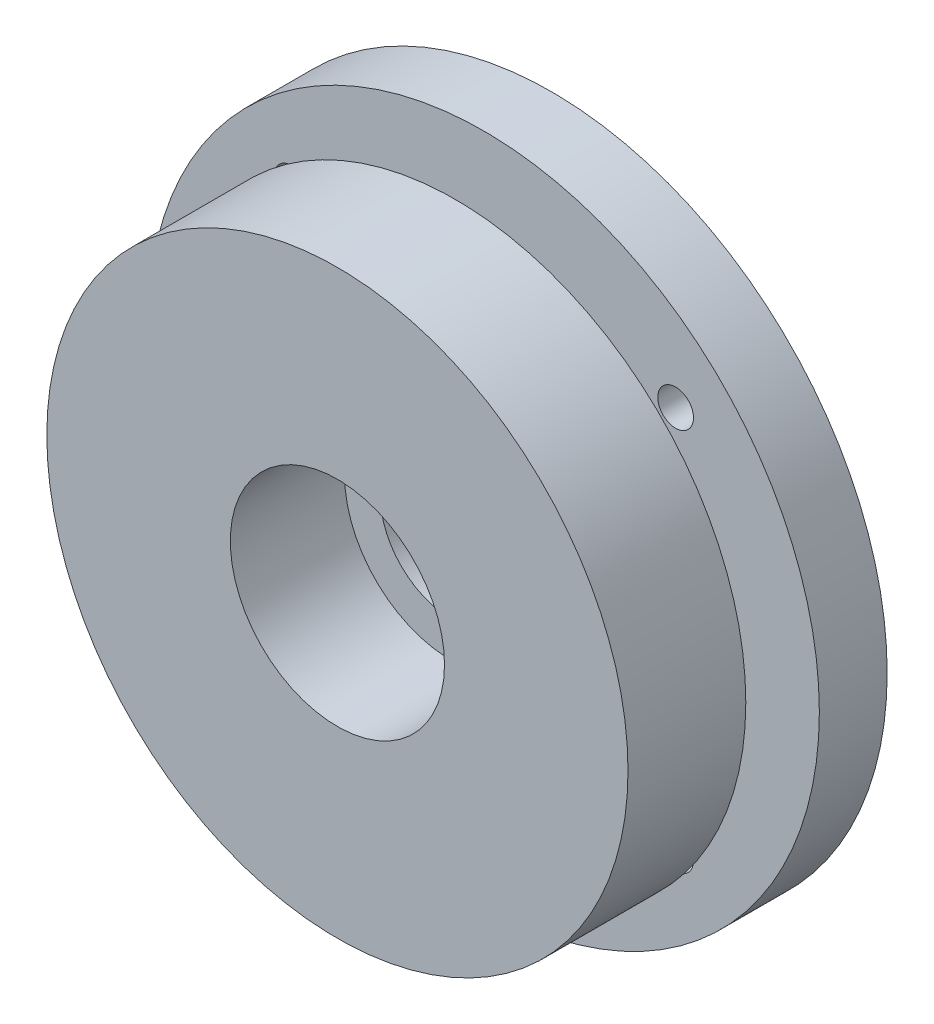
ISO-10303-21;
HEADER;
FILE_DESCRIPTION(('STEP AP214'),'2;1');
FILE_NAME('part.step','',(''),(''),'','','');
FILE_SCHEMA(('AUTOMOTIVE_DESIGN { 1 0 10303 214 1 1 1 1 }'));
ENDSEC;
DATA;
#1=APPLICATION_CONTEXT('core data for automotive mechanical design processes');
#2=APPLICATION_PROTOCOL_DEFINITION('international standard','automotive_design',2000,#1);
#3=PRODUCT_CONTEXT('',#1,'mechanical');
#4=PRODUCT('Part','Part','',(#3));
#5=PRODUCT_RELATED_PRODUCT_CATEGORY('part','',(#4));
#6=PRODUCT_DEFINITION_FORMATION('','',#4);
#7=PRODUCT_DEFINITION_CONTEXT('part definition',#1,'design');
#8=PRODUCT_DEFINITION('design','',#6,#7);
#9=PRODUCT_DEFINITION_SHAPE('','',#8);
#10=(LENGTH_UNIT() NAMED_UNIT(*) SI_UNIT(.MILLI.,.METRE.));
#11=(NAMED_UNIT(*) PLANE_ANGLE_UNIT() SI_UNIT($,.RADIAN.));
#12=(NAMED_UNIT(*) SI_UNIT($,.STERADIAN.) SOLID_ANGLE_UNIT());
#13=UNCERTAINTY_MEASURE_WITH_UNIT(LENGTH_MEASURE(1.E-05),#10,'distance_accuracy_value','');
#14=(GEOMETRIC_REPRESENTATION_CONTEXT(3) GLOBAL_UNCERTAINTY_ASSIGNED_CONTEXT((#13)) GLOBAL_UNIT_ASSIGNED_CONTEXT((#10,
#11,#12)) REPRESENTATION_CONTEXT('',''));
#15=CARTESIAN_POINT('',(0.,0.,0.));
#16=DIRECTION('',(0.,0.,1.));
#17=DIRECTION('',(1.,0.,0.));
#18=AXIS2_PLACEMENT_3D('',#15,#16,#17);
#19=CARTESIAN_POINT('',(0.,0.,-133.5));
#20=DIRECTION('',(0.,0.,1.));
#21=DIRECTION('',(1.,0.,0.));
#22=AXIS2_PLACEMENT_3D('',#19,#20,#21);
#23=CYLINDRICAL_SURFACE('',#22,7.5);
#24=CARTESIAN_POINT('',(0.,0.,15.));
#25=DIRECTION('',(0.,0.,1.));
#26=DIRECTION('',(1.,0.,0.));
#27=AXIS2_PLACEMENT_3D('',#24,#25,#26);
#28=CIRCLE('',#27,7.5);
#29=CARTESIAN_POINT('',(7.5,0.,15.));
#30=VERTEX_POINT('',#29);
#31=EDGE_CURVE('E95',#30,#30,#28,.T.);
#32=ORIENTED_EDGE('',*,*,#31,.T.);
#33=EDGE_LOOP('',(#32));
#34=FACE_BOUND('',#33,.T.);
#35=CARTESIAN_POINT('',(0.,0.,7.));
#36=DIRECTION('',(0.,0.,-1.));
#37=DIRECTION('',(-1.,0.,0.));
#38=AXIS2_PLACEMENT_3D('',#35,#36,#37);
#39=CIRCLE('',#38,7.5);
#40=CARTESIAN_POINT('',(-7.5,0.,7.));
#41=VERTEX_POINT('',#40);
#42=EDGE_CURVE('E10',#41,#41,#39,.F.);
#43=ORIENTED_EDGE('',*,*,#42,.F.);
#44=EDGE_LOOP('',(#43));
#45=FACE_BOUND('',#44,.T.);
#46=ADVANCED_FACE('F14',(#34,#45),#23,.F.);
#47=CARTESIAN_POINT('',(0.,0.,15.));
#48=DIRECTION('',(0.,0.,-1.));
#49=DIRECTION('',(-1.,0.,0.));
#50=AXIS2_PLACEMENT_3D('',#47,#48,#49);
#51=CYLINDRICAL_SURFACE('',#50,20.35);
#52=CARTESIAN_POINT('',(0.,0.,15.));
#53=DIRECTION('',(0.,0.,1.));
#54=DIRECTION('',(1.,0.,0.));
#55=AXIS2_PLACEMENT_3D('',#52,#53,#54);
#56=CIRCLE('',#55,20.35);
#57=CARTESIAN_POINT('',(20.35,0.,15.));
#58=VERTEX_POINT('',#57);
#59=EDGE_CURVE('E23',#58,#58,#56,.T.);
#60=ORIENTED_EDGE('',*,*,#59,.F.);
#61=EDGE_LOOP('',(#60));
#62=FACE_BOUND('',#61,.T.);
#63=CARTESIAN_POINT('',(0.,0.,6.75));
#64=DIRECTION('',(0.,0.,1.));
#65=DIRECTION('',(1.,0.,0.));
#66=AXIS2_PLACEMENT_3D('',#63,#64,#65);
#67=CIRCLE('',#66,20.35);
#68=CARTESIAN_POINT('',(20.35,0.,6.75));
#69=VERTEX_POINT('',#68);
#70=EDGE_CURVE('E33',#69,#69,#67,.T.);
#71=ORIENTED_EDGE('',*,*,#70,.T.);
#72=EDGE_LOOP('',(#71));
#73=FACE_BOUND('',#72,.T.);
#74=ADVANCED_FACE('F16',(#62,#73),#51,.T.);
#75=CARTESIAN_POINT('',(0.,0.,15.));
#76=DIRECTION('',(0.,0.,1.));
#77=DIRECTION('',(1.,0.,0.));
#78=AXIS2_PLACEMENT_3D('',#75,#76,#77);
#79=PLANE('',#78);
#80=ORIENTED_EDGE('',*,*,#31,.F.);
#81=EDGE_LOOP('',(#80));
#82=FACE_BOUND('',#81,.T.);
#83=ORIENTED_EDGE('',*,*,#59,.T.);
#84=EDGE_LOOP('',(#83));
#85=FACE_BOUND('',#84,.T.);
#86=ADVANCED_FACE('F154',(#82,#85),#79,.T.);
#87=CARTESIAN_POINT('',(0.,0.,6.75));
#88=DIRECTION('',(0.,0.,1.));
#89=DIRECTION('',(1.,0.,0.));
#90=AXIS2_PLACEMENT_3D('',#87,#88,#89);
#91=PLANE('',#90);
#92=CARTESIAN_POINT('',(0.,0.,6.75));
#93=DIRECTION('',(0.,0.,1.));
#94=DIRECTION('',(1.,0.,0.));
#95=AXIS2_PLACEMENT_3D('',#92,#93,#94);
#96=CIRCLE('',#95,11.5);
#97=CARTESIAN_POINT('',(11.5,0.,6.75));
#98=VERTEX_POINT('',#97);
#99=EDGE_CURVE('E110',#98,#98,#96,.T.);
#100=ORIENTED_EDGE('',*,*,#99,.T.);
#101=EDGE_LOOP('',(#100));
#102=FACE_BOUND('',#101,.T.);
#103=ORIENTED_EDGE('',*,*,#70,.F.);
#104=EDGE_LOOP('',(#103));
#105=FACE_BOUND('',#104,.T.);
#106=ADVANCED_FACE('F310',(#102,#105),#91,.F.);
#107=CARTESIAN_POINT('',(0.,0.,4.75));
#108=DIRECTION('',(0.,0.,-1.));
#109=DIRECTION('',(-1.,0.,0.));
#110=AXIS2_PLACEMENT_3D('',#107,#108,#109);
#111=CYLINDRICAL_SURFACE('',#110,23.5);
#112=CARTESIAN_POINT('',(0.,0.,4.75));
#113=DIRECTION('',(0.,0.,1.));
#114=DIRECTION('',(1.,0.,0.));
#115=AXIS2_PLACEMENT_3D('',#112,#113,#114);
#116=CIRCLE('',#115,23.5);
#117=CARTESIAN_POINT('',(23.5,0.,4.75));
#118=VERTEX_POINT('',#117);
#119=EDGE_CURVE('E115',#118,#118,#116,.T.);
#120=ORIENTED_EDGE('',*,*,#119,.F.);
#121=EDGE_LOOP('',(#120));
#122=FACE_BOUND('',#121,.T.);
#123=CARTESIAN_POINT('',(0.,0.,0.));
#124=DIRECTION('',(0.,0.,1.));
#125=DIRECTION('',(1.,0.,0.));
#126=AXIS2_PLACEMENT_3D('',#123,#124,#125);
#127=CIRCLE('',#126,23.5);
#128=CARTESIAN_POINT('',(23.5,0.,0.));
#129=VERTEX_POINT('',#128);
#130=EDGE_CURVE('E119',#129,#129,#127,.T.);
#131=ORIENTED_EDGE('',*,*,#130,.T.);
#132=EDGE_LOOP('',(#131));
#133=FACE_BOUND('',#132,.T.);
#134=ADVANCED_FACE('F129',(#122,#133),#111,.T.);
#135=CARTESIAN_POINT('',(0.,0.,4.75));
#136=DIRECTION('',(0.,0.,1.));
#137=DIRECTION('',(1.,0.,0.));
#138=AXIS2_PLACEMENT_3D('',#135,#136,#137);
#139=PLANE('',#138);
#140=CARTESIAN_POINT('',(13.4350288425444,13.4350288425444,4.75));
#141=DIRECTION('',(0.,0.,1.));
#142=DIRECTION('',(1.,0.,0.));
#143=AXIS2_PLACEMENT_3D('',#140,#141,#142);
#144=CIRCLE('',#143,1.25);
#145=CARTESIAN_POINT('',(14.6850288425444,13.4350288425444,4.75));
#146=VERTEX_POINT('',#145);
#147=EDGE_CURVE('E64',#146,#146,#144,.T.);
#148=ORIENTED_EDGE('',*,*,#147,.F.);
#149=EDGE_LOOP('',(#148));
#150=FACE_BOUND('',#149,.T.);
#151=CARTESIAN_POINT('',(13.4350288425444,-13.4350288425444,4.75));
#152=DIRECTION('',(0.,0.,1.));
#153=DIRECTION('',(1.,0.,0.));
#154=AXIS2_PLACEMENT_3D('',#151,#152,#153);
#155=CIRCLE('',#154,1.25);
#156=CARTESIAN_POINT('',(14.6850288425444,-13.4350288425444,4.75));
#157=VERTEX_POINT('',#156);
#158=EDGE_CURVE('E56',#157,#157,#155,.T.);
#159=ORIENTED_EDGE('',*,*,#158,.F.);
#160=EDGE_LOOP('',(#159));
#161=FACE_BOUND('',#160,.T.);
#162=CARTESIAN_POINT('',(-13.4350288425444,13.4350288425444,4.75));
#163=DIRECTION('',(0.,0.,1.));
#164=DIRECTION('',(1.,0.,0.));
#165=AXIS2_PLACEMENT_3D('',#162,#163,#164);
#166=CIRCLE('',#165,1.25);
#167=CARTESIAN_POINT('',(-12.1850288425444,13.4350288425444,4.75));
#168=VERTEX_POINT('',#167);
#169=EDGE_CURVE('E47',#168,#168,#166,.T.);
#170=ORIENTED_EDGE('',*,*,#169,.F.);
#171=EDGE_LOOP('',(#170));
#172=FACE_BOUND('',#171,.T.);
#173=CARTESIAN_POINT('',(-13.4350288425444,-13.4350288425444,4.75));
#174=DIRECTION('',(0.,0.,1.));
#175=DIRECTION('',(1.,0.,0.));
#176=AXIS2_PLACEMENT_3D('',#173,#174,#175);
#177=CIRCLE('',#176,1.25);
#178=CARTESIAN_POINT('',(-12.1850288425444,-13.4350288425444,4.75));
#179=VERTEX_POINT('',#178);
#180=EDGE_CURVE('E37',#179,#179,#177,.T.);
#181=ORIENTED_EDGE('',*,*,#180,.F.);
#182=EDGE_LOOP('',(#181));
#183=FACE_BOUND('',#182,.T.);
#184=CARTESIAN_POINT('',(0.,0.,4.75));
#185=DIRECTION('',(0.,0.,1.));
#186=DIRECTION('',(1.,0.,0.));
#187=AXIS2_PLACEMENT_3D('',#184,#185,#186);
#188=CIRCLE('',#187,11.5);
#189=CARTESIAN_POINT('',(11.5,0.,4.75));
#190=VERTEX_POINT('',#189);
#191=EDGE_CURVE('E111',#190,#190,#188,.T.);
#192=ORIENTED_EDGE('',*,*,#191,.F.);
#193=EDGE_LOOP('',(#192));
#194=FACE_BOUND('',#193,.T.);
#195=ORIENTED_EDGE('',*,*,#119,.T.);
#196=EDGE_LOOP('',(#195));
#197=FACE_BOUND('',#196,.T.);
#198=ADVANCED_FACE('F134',(#150,#161,#172,#183,#194,#197),#139,.T.);
#199=CARTESIAN_POINT('',(0.,0.,0.));
#200=DIRECTION('',(0.,0.,1.));
#201=DIRECTION('',(1.,0.,0.));
#202=AXIS2_PLACEMENT_3D('',#199,#200,#201);
#203=PLANE('',#202);
#204=CARTESIAN_POINT('',(13.4350288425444,13.4350288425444,0.));
#205=DIRECTION('',(0.,0.,1.));
#206=DIRECTION('',(1.,0.,0.));
#207=AXIS2_PLACEMENT_3D('',#204,#205,#206);
#208=CIRCLE('',#207,1.5);
#209=CARTESIAN_POINT('',(14.9350288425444,13.4350288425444,0.));
#210=VERTEX_POINT('',#209);
#211=EDGE_CURVE('E67',#210,#210,#208,.T.);
#212=ORIENTED_EDGE('',*,*,#211,.T.);
#213=EDGE_LOOP('',(#212));
#214=FACE_BOUND('',#213,.T.);
#215=CARTESIAN_POINT('',(13.4350288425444,-13.4350288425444,0.));
#216=DIRECTION('',(0.,0.,1.));
#217=DIRECTION('',(1.,0.,0.));
#218=AXIS2_PLACEMENT_3D('',#215,#216,#217);
#219=CIRCLE('',#218,1.5);
#220=CARTESIAN_POINT('',(14.9350288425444,-13.4350288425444,0.));
#221=VERTEX_POINT('',#220);
#222=EDGE_CURVE('E60',#221,#221,#219,.T.);
#223=ORIENTED_EDGE('',*,*,#222,.T.);
#224=EDGE_LOOP('',(#223));
#225=FACE_BOUND('',#224,.T.);
#226=CARTESIAN_POINT('',(-13.4350288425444,13.4350288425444,0.));
#227=DIRECTION('',(0.,0.,1.));
#228=DIRECTION('',(1.,0.,0.));
#229=AXIS2_PLACEMENT_3D('',#226,#227,#228);
#230=CIRCLE('',#229,1.5);
#231=CARTESIAN_POINT('',(-11.9350288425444,13.4350288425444,0.));
#232=VERTEX_POINT('',#231);
#233=EDGE_CURVE('E51',#232,#232,#230,.T.);
#234=ORIENTED_EDGE('',*,*,#233,.T.);
#235=EDGE_LOOP('',(#234));
#236=FACE_BOUND('',#235,.T.);
#237=CARTESIAN_POINT('',(-13.4350288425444,-13.4350288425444,0.));
#238=DIRECTION('',(0.,0.,1.));
#239=DIRECTION('',(1.,0.,0.));
#240=AXIS2_PLACEMENT_3D('',#237,#238,#239);
#241=CIRCLE('',#240,1.5);
#242=CARTESIAN_POINT('',(-11.9350288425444,-13.4350288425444,0.));
#243=VERTEX_POINT('',#242);
#244=EDGE_CURVE('E42',#243,#243,#241,.T.);
#245=ORIENTED_EDGE('',*,*,#244,.T.);
#246=EDGE_LOOP('',(#245));
#247=FACE_BOUND('',#246,.T.);
#248=CARTESIAN_POINT('',(0.,0.,0.));
#249=DIRECTION('',(0.,0.,1.));
#250=DIRECTION('',(1.,0.,0.));
#251=AXIS2_PLACEMENT_3D('',#248,#249,#250);
#252=CIRCLE('',#251,7.5);
#253=CARTESIAN_POINT('',(7.5,0.,0.));
#254=VERTEX_POINT('',#253);
#255=EDGE_CURVE('E106',#254,#254,#252,.F.);
#256=ORIENTED_EDGE('',*,*,#255,.F.);
#257=EDGE_LOOP('',(#256));
#258=FACE_BOUND('',#257,.T.);
#259=ORIENTED_EDGE('',*,*,#130,.F.);
#260=EDGE_LOOP('',(#259));
#261=FACE_BOUND('',#260,.T.);
#262=ADVANCED_FACE('F131',(#214,#225,#236,#247,#258,#261),#203,.F.);
#263=CARTESIAN_POINT('',(0.,0.,24.55));
#264=DIRECTION('',(0.,0.,-1.));
#265=DIRECTION('',(-1.,0.,0.));
#266=AXIS2_PLACEMENT_3D('',#263,#264,#265);
#267=CYLINDRICAL_SURFACE('',#266,11.5);
#268=ORIENTED_EDGE('',*,*,#191,.T.);
#269=EDGE_LOOP('',(#268));
#270=FACE_BOUND('',#269,.T.);
#271=ORIENTED_EDGE('',*,*,#99,.F.);
#272=EDGE_LOOP('',(#271));
#273=FACE_BOUND('',#272,.T.);
#274=ADVANCED_FACE('F133',(#270,#273),#267,.T.);
#275=CARTESIAN_POINT('',(0.,0.,3.5));
#276=DIRECTION('',(0.,0.,-1.));
#277=DIRECTION('',(1.,0.,0.));
#278=AXIS2_PLACEMENT_3D('',#275,#276,#277);
#279=CIRCLE('',#278,7.5);
#280=CARTESIAN_POINT('',(7.5,0.,3.5));
#281=VERTEX_POINT('',#280);
#282=EDGE_CURVE('E41',#281,#281,#279,.T.);
#283=ORIENTED_EDGE('',*,*,#282,.F.);
#284=EDGE_LOOP('',(#283));
#285=FACE_BOUND('',#284,.T.);
#286=ORIENTED_EDGE('',*,*,#255,.T.);
#287=EDGE_LOOP('',(#286));
#288=FACE_BOUND('',#287,.T.);
#289=ADVANCED_FACE('F141',(#285,#288),#23,.F.);
#290=CARTESIAN_POINT('',(0.,0.,7.));
#291=DIRECTION('',(0.,0.,-1.));
#292=DIRECTION('',(-1.,0.,0.));
#293=AXIS2_PLACEMENT_3D('',#290,#291,#292);
#294=CYLINDRICAL_SURFACE('',#293,5.);
#295=CARTESIAN_POINT('',(0.,0.,7.));
#296=DIRECTION('',(0.,0.,-1.));
#297=DIRECTION('',(1.,0.,0.));
#298=AXIS2_PLACEMENT_3D('',#295,#296,#297);
#299=CIRCLE('',#298,5.);
#300=CARTESIAN_POINT('',(5.,0.,7.));
#301=VERTEX_POINT('',#300);
#302=EDGE_CURVE('E91',#301,#301,#299,.T.);
#303=ORIENTED_EDGE('',*,*,#302,.F.);
#304=EDGE_LOOP('',(#303));
#305=FACE_BOUND('',#304,.T.);
#306=CARTESIAN_POINT('',(0.,0.,3.5));
#307=DIRECTION('',(0.,0.,-1.));
#308=DIRECTION('',(1.,0.,0.));
#309=AXIS2_PLACEMENT_3D('',#306,#307,#308);
#310=CIRCLE('',#309,5.);
#311=CARTESIAN_POINT('',(5.,0.,3.5));
#312=VERTEX_POINT('',#311);
#313=EDGE_CURVE('E96',#312,#312,#310,.T.);
#314=ORIENTED_EDGE('',*,*,#313,.T.);
#315=EDGE_LOOP('',(#314));
#316=FACE_BOUND('',#315,.T.);
#317=ADVANCED_FACE('F159',(#305,#316),#294,.F.);
#318=CARTESIAN_POINT('',(0.,0.,7.));
#319=DIRECTION('',(0.,0.,-1.));
#320=DIRECTION('',(-1.,0.,0.));
#321=AXIS2_PLACEMENT_3D('',#318,#319,#320);
#322=PLANE('',#321);
#323=ORIENTED_EDGE('',*,*,#42,.T.);
#324=EDGE_LOOP('',(#323));
#325=FACE_BOUND('',#324,.T.);
#326=ORIENTED_EDGE('',*,*,#302,.T.);
#327=EDGE_LOOP('',(#326));
#328=FACE_BOUND('',#327,.T.);
#329=ADVANCED_FACE('F164',(#325,#328),#322,.F.);
#330=CARTESIAN_POINT('',(0.,0.,3.5));
#331=DIRECTION('',(0.,0.,-1.));
#332=DIRECTION('',(-1.,0.,0.));
#333=AXIS2_PLACEMENT_3D('',#330,#331,#332);
#334=PLANE('',#333);
#335=ORIENTED_EDGE('',*,*,#282,.T.);
#336=EDGE_LOOP('',(#335));
#337=FACE_BOUND('',#336,.T.);
#338=ORIENTED_EDGE('',*,*,#313,.F.);
#339=EDGE_LOOP('',(#338));
#340=FACE_BOUND('',#339,.T.);
#341=ADVANCED_FACE('F171',(#337,#340),#334,.T.);
#342=CARTESIAN_POINT('',(-13.4350288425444,-13.4350288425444,0.));
#343=DIRECTION('',(0.,0.,1.));
#344=DIRECTION('',(1.,0.,0.));
#345=AXIS2_PLACEMENT_3D('',#342,#343,#344);
#346=CYLINDRICAL_SURFACE('',#345,1.25);
#347=CARTESIAN_POINT('',(-13.4350288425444,-13.4350288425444,0.25));
#348=DIRECTION('',(0.,0.,-1.));
#349=DIRECTION('',(-1.,0.,0.));
#350=AXIS2_PLACEMENT_3D('',#347,#348,#349);
#351=CIRCLE('',#350,1.25);
#352=CARTESIAN_POINT('',(-14.6850288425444,-13.4350288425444,0.25));
#353=VERTEX_POINT('',#352);
#354=EDGE_CURVE('E43',#353,#353,#351,.T.);
#355=ORIENTED_EDGE('',*,*,#354,.T.);
#356=EDGE_LOOP('',(#355));
#357=FACE_BOUND('',#356,.T.);
#358=ORIENTED_EDGE('',*,*,#180,.T.);
#359=EDGE_LOOP('',(#358));
#360=FACE_BOUND('',#359,.T.);
#361=ADVANCED_FACE('F174',(#357,#360),#346,.F.);
#362=CARTESIAN_POINT('',(-13.4350288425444,-13.4350288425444,1.5));
#363=DIRECTION('',(0.,0.,-1.));
#364=DIRECTION('',(-1.,0.,0.));
#365=AXIS2_PLACEMENT_3D('',#362,#363,#364);
#366=CONICAL_SURFACE('',#365,0.,0.785398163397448);
#367=ORIENTED_EDGE('',*,*,#354,.F.);
#368=EDGE_LOOP('',(#367));
#369=FACE_BOUND('',#368,.T.);
#370=ORIENTED_EDGE('',*,*,#244,.F.);
#371=EDGE_LOOP('',(#370));
#372=FACE_BOUND('',#371,.T.);
#373=ADVANCED_FACE('F182',(#369,#372),#366,.F.);
#374=CARTESIAN_POINT('',(-13.4350288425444,13.4350288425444,0.));
#375=DIRECTION('',(0.,0.,1.));
#376=DIRECTION('',(1.,0.,0.));
#377=AXIS2_PLACEMENT_3D('',#374,#375,#376);
#378=CYLINDRICAL_SURFACE('',#377,1.25);
#379=CARTESIAN_POINT('',(-13.4350288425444,13.4350288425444,0.25));
#380=DIRECTION('',(0.,0.,-1.));
#381=DIRECTION('',(-1.,0.,0.));
#382=AXIS2_PLACEMENT_3D('',#379,#380,#381);
#383=CIRCLE('',#382,1.25);
#384=CARTESIAN_POINT('',(-14.6850288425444,13.4350288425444,0.25));
#385=VERTEX_POINT('',#384);
#386=EDGE_CURVE('E52',#385,#385,#383,.T.);
#387=ORIENTED_EDGE('',*,*,#386,.T.);
#388=EDGE_LOOP('',(#387));
#389=FACE_BOUND('',#388,.T.);
#390=ORIENTED_EDGE('',*,*,#169,.T.);
#391=EDGE_LOOP('',(#390));
#392=FACE_BOUND('',#391,.T.);
#393=ADVANCED_FACE('F189',(#389,#392),#378,.F.);
#394=CARTESIAN_POINT('',(-13.4350288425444,13.4350288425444,1.5));
#395=DIRECTION('',(0.,0.,-1.));
#396=DIRECTION('',(-1.,0.,0.));
#397=AXIS2_PLACEMENT_3D('',#394,#395,#396);
#398=CONICAL_SURFACE('',#397,0.,0.785398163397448);
#399=ORIENTED_EDGE('',*,*,#386,.F.);
#400=EDGE_LOOP('',(#399));
#401=FACE_BOUND('',#400,.T.);
#402=ORIENTED_EDGE('',*,*,#233,.F.);
#403=EDGE_LOOP('',(#402));
#404=FACE_BOUND('',#403,.T.);
#405=ADVANCED_FACE('F193',(#401,#404),#398,.F.);
#406=CARTESIAN_POINT('',(13.4350288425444,-13.4350288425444,0.));
#407=DIRECTION('',(0.,0.,1.));
#408=DIRECTION('',(1.,0.,0.));
#409=AXIS2_PLACEMENT_3D('',#406,#407,#408);
#410=CYLINDRICAL_SURFACE('',#409,1.25);
#411=CARTESIAN_POINT('',(13.4350288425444,-13.4350288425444,0.25));
#412=DIRECTION('',(0.,0.,-1.));
#413=DIRECTION('',(-1.,0.,0.));
#414=AXIS2_PLACEMENT_3D('',#411,#412,#413);
#415=CIRCLE('',#414,1.25);
#416=CARTESIAN_POINT('',(12.1850288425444,-13.4350288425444,0.25));
#417=VERTEX_POINT('',#416);
#418=EDGE_CURVE('E61',#417,#417,#415,.T.);
#419=ORIENTED_EDGE('',*,*,#418,.T.);
#420=EDGE_LOOP('',(#419));
#421=FACE_BOUND('',#420,.T.);
#422=ORIENTED_EDGE('',*,*,#158,.T.);
#423=EDGE_LOOP('',(#422));
#424=FACE_BOUND('',#423,.T.);
#425=ADVANCED_FACE('F197',(#421,#424),#410,.F.);
#426=CARTESIAN_POINT('',(13.4350288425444,-13.4350288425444,1.5));
#427=DIRECTION('',(0.,0.,-1.));
#428=DIRECTION('',(-1.,0.,0.));
#429=AXIS2_PLACEMENT_3D('',#426,#427,#428);
#430=CONICAL_SURFACE('',#429,0.,0.785398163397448);
#431=ORIENTED_EDGE('',*,*,#418,.F.);
#432=EDGE_LOOP('',(#431));
#433=FACE_BOUND('',#432,.T.);
#434=ORIENTED_EDGE('',*,*,#222,.F.);
#435=EDGE_LOOP('',(#434));
#436=FACE_BOUND('',#435,.T.);
#437=ADVANCED_FACE('F201',(#433,#436),#430,.F.);
#438=CARTESIAN_POINT('',(13.4350288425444,13.4350288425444,0.));
#439=DIRECTION('',(0.,0.,1.));
#440=DIRECTION('',(1.,0.,0.));
#441=AXIS2_PLACEMENT_3D('',#438,#439,#440);
#442=CYLINDRICAL_SURFACE('',#441,1.25);
#443=CARTESIAN_POINT('',(13.4350288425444,13.4350288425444,0.25));
#444=DIRECTION('',(0.,0.,-1.));
#445=DIRECTION('',(-1.,0.,0.));
#446=AXIS2_PLACEMENT_3D('',#443,#444,#445);
#447=CIRCLE('',#446,1.25);
#448=CARTESIAN_POINT('',(12.1850288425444,13.4350288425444,0.25));
#449=VERTEX_POINT('',#448);
#450=EDGE_CURVE('E18',#449,#449,#447,.T.);
#451=ORIENTED_EDGE('',*,*,#450,.T.);
#452=EDGE_LOOP('',(#451));
#453=FACE_BOUND('',#452,.T.);
#454=ORIENTED_EDGE('',*,*,#147,.T.);
#455=EDGE_LOOP('',(#454));
#456=FACE_BOUND('',#455,.T.);
#457=ADVANCED_FACE('F205',(#453,#456),#442,.F.);
#458=CARTESIAN_POINT('',(13.4350288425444,13.4350288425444,1.5));
#459=DIRECTION('',(0.,0.,-1.));
#460=DIRECTION('',(-1.,0.,0.));
#461=AXIS2_PLACEMENT_3D('',#458,#459,#460);
#462=CONICAL_SURFACE('',#461,0.,0.785398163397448);
#463=ORIENTED_EDGE('',*,*,#450,.F.);
#464=EDGE_LOOP('',(#463));
#465=FACE_BOUND('',#464,.T.);
#466=ORIENTED_EDGE('',*,*,#211,.F.);
#467=EDGE_LOOP('',(#466));
#468=FACE_BOUND('',#467,.T.);
#469=ADVANCED_FACE('F209',(#465,#468),#462,.F.);
#470=CLOSED_SHELL('',(#46,#74,#86,#106,#134,#198,#262,#274,#289,#317,#329,#341,#361,#373,#393,
#405,#425,#437,#457,#469));
#471=MANIFOLD_SOLID_BREP('B1',#470);
#472=ADVANCED_BREP_SHAPE_REPRESENTATION('',(#18,#471),#14);
#473=SHAPE_DEFINITION_REPRESENTATION(#9,#472);
ENDSEC;
END-ISO-10303-21;
